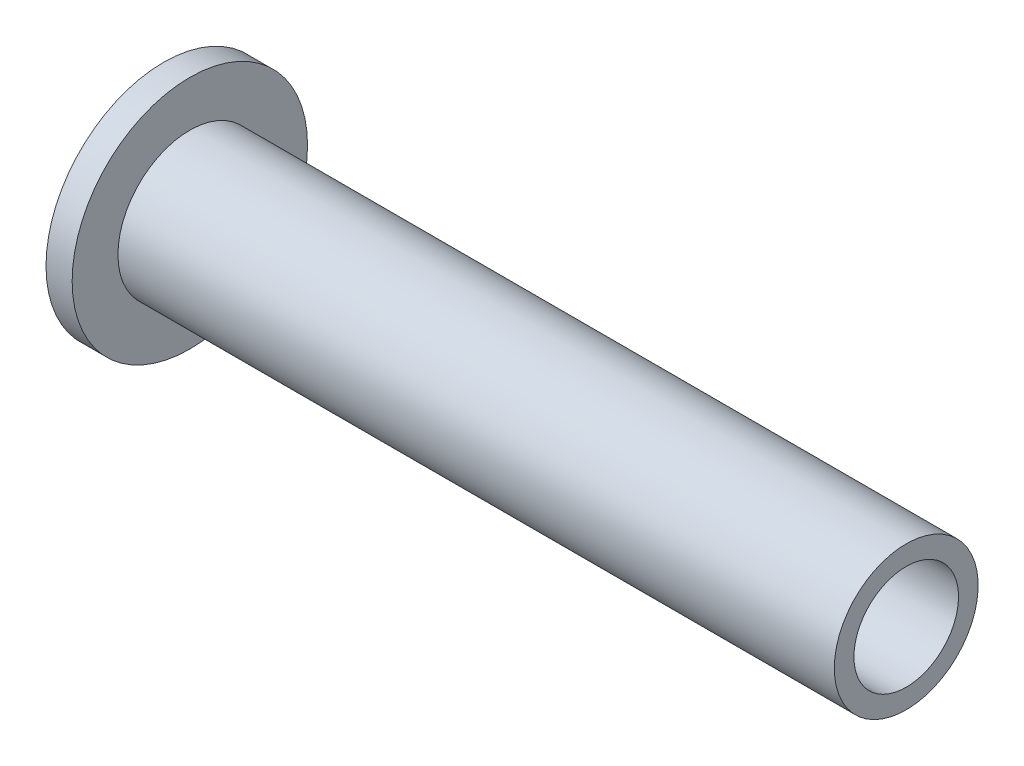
from build123d import *


with BuildPart() as part:
    # Esquisse1 → Base-R_volution (revolve)
    with BuildSketch(Plane.XY, mode=Mode.PRIVATE) as base_r_volution_sk:
        Polygon((0, 4), (56.7853, 4), (56.7853, 5.5), (2, 5.5), (2, 9), (0, 9), align=None)
    revolve(base_r_volution_sk.sketch.rotate(Axis((0, 0, 0), (1, 0, 0)), 90), axis=Axis((0, 0, 0), (1, 0, 0)))


solid = part.part
